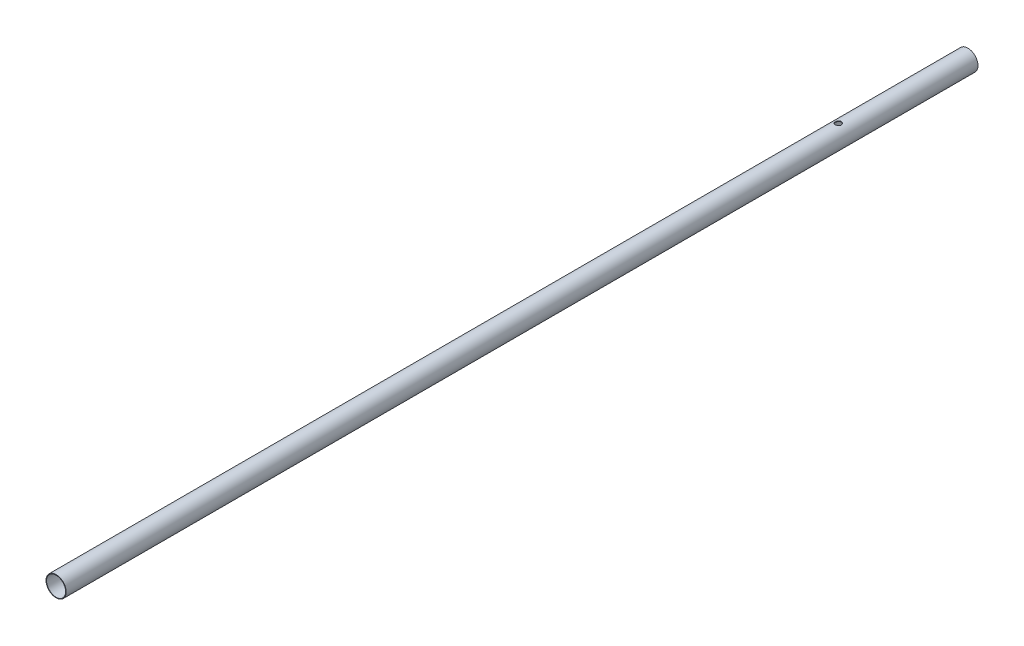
from build123d import *

# Parameters (mm, degrees)
ESQUISSE1_R                  = 17
EXTRUSION1_DEPTH             = 1532
ESQUISSE2_R                  = 16
ENL_V_MAT_EXTRU_1_DEPTH      = 1533.188630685
ENL_V_MAT_EXTRU_2_DEPTH      = 1533.332209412
ENL_V_MAT_EXTRU_2_DEPTH_BACK = 1533.332209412
ESQUISSE3_R                  = 5


with BuildPart() as part:
    # Esquisse1 → Extrusion1 (new body)
    with BuildSketch(Plane.XY):
        Circle(ESQUISSE1_R)
    extrude(amount=EXTRUSION1_DEPTH)

    # Esquisse2 → Enl_v. mat.-Extru.1 (cut, through all)
    with BuildSketch(Plane.XY.offset(1532)):
        Circle(ESQUISSE2_R)
    extrude(amount=-ENL_V_MAT_EXTRU_1_DEPTH, mode=Mode.SUBTRACT)

    # Esquisse3 → Enl_v. mat.-Extru.2 (cut, two sides: drawn at the far end of the back side and taken through both)
    with BuildSketch(Plane(origin=(0, 10, 0), x_dir=(-1, 0, 0), z_dir=(0, 1, 0)).offset(-ENL_V_MAT_EXTRU_2_DEPTH_BACK)):
        with Locations(Location((0, 218, 0), (0, 0, 90))):
            Circle(ESQUISSE3_R)
    extrude(amount=ENL_V_MAT_EXTRU_2_DEPTH + ENL_V_MAT_EXTRU_2_DEPTH_BACK, mode=Mode.SUBTRACT)


solid = part.part
